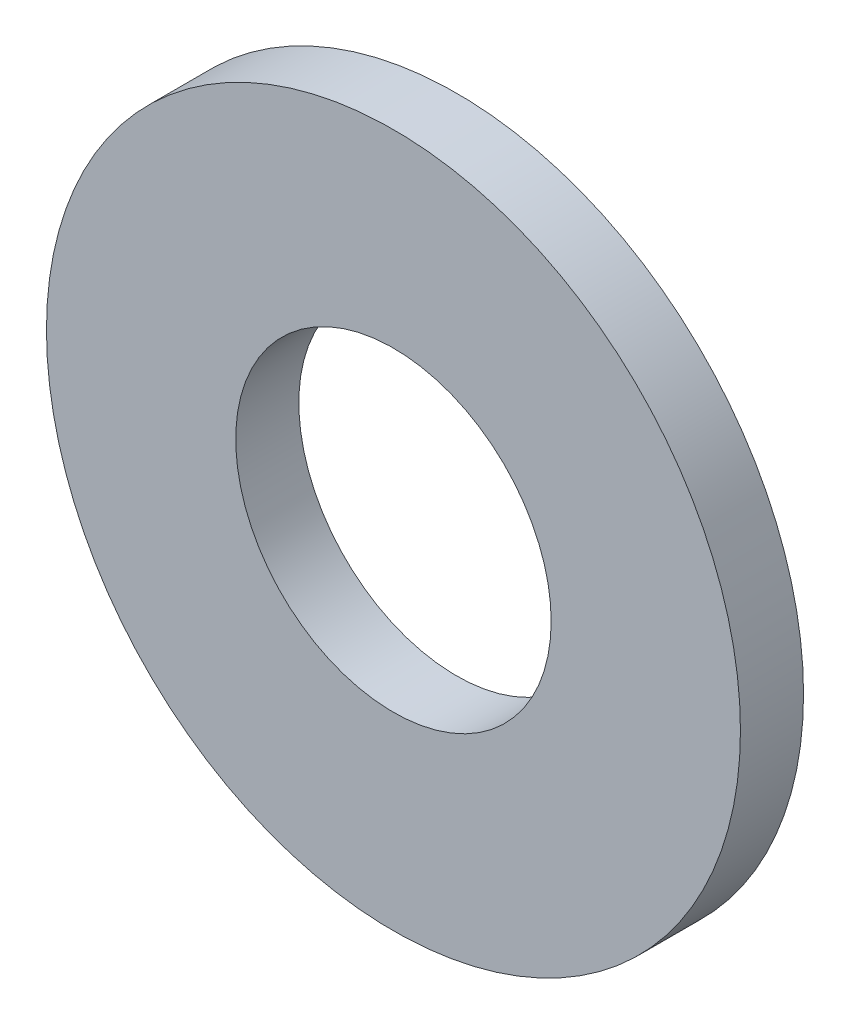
from build123d import *

# Parameters (mm, degrees)
ESQUISSE1_R      = 11
ESQUISSE1_R_2    = 5
EXTRUSION1_DEPTH = 2


with BuildPart() as part:
    # Esquisse1 → Extrusion1 (new body)
    with BuildSketch(Plane.XY):
        Circle(ESQUISSE1_R)
        Circle(ESQUISSE1_R_2, mode=Mode.SUBTRACT)
    extrude(amount=EXTRUSION1_DEPTH)


solid = part.part
